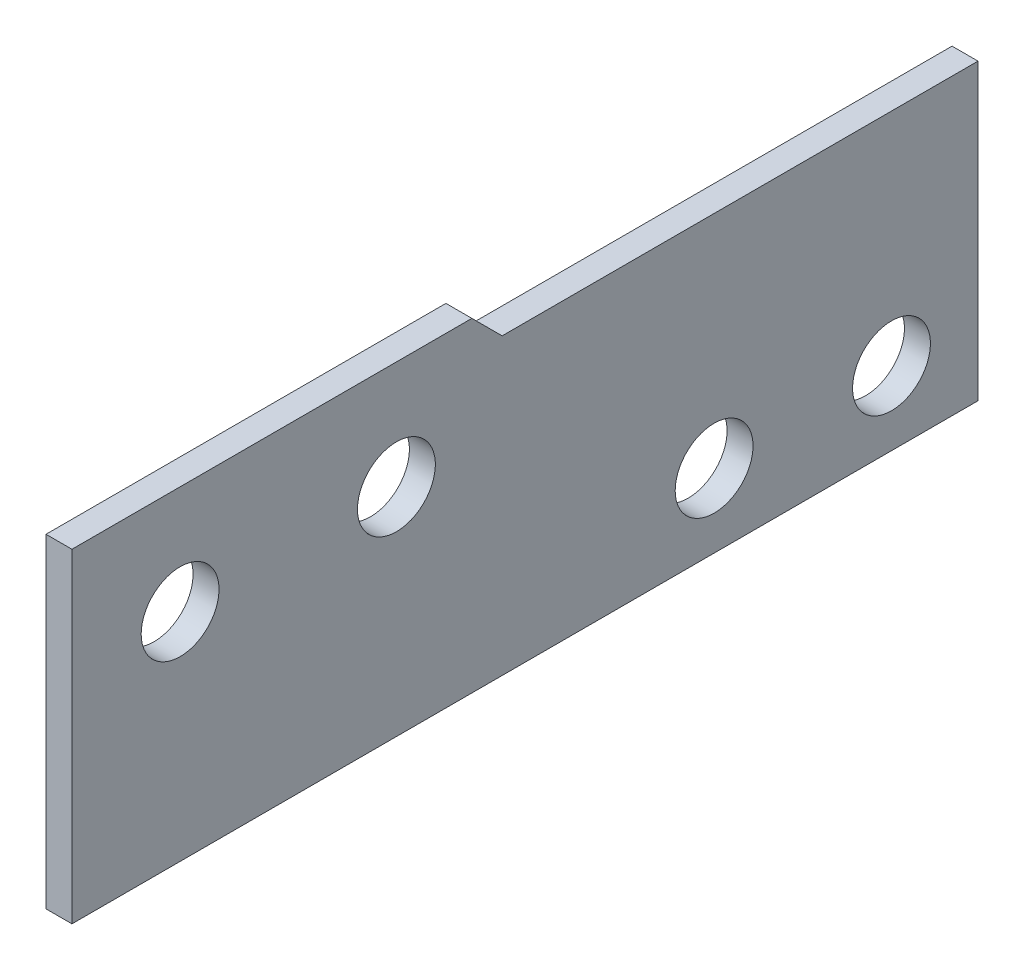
ISO-10303-21;
HEADER;
FILE_DESCRIPTION(('STEP AP214'),'2;1');
FILE_NAME('part.step','',(''),(''),'','','');
FILE_SCHEMA(('AUTOMOTIVE_DESIGN { 1 0 10303 214 1 1 1 1 }'));
ENDSEC;
DATA;
#1=APPLICATION_CONTEXT('core data for automotive mechanical design processes');
#2=APPLICATION_PROTOCOL_DEFINITION('international standard','automotive_design',2000,#1);
#3=PRODUCT_CONTEXT('',#1,'mechanical');
#4=PRODUCT('Part','Part','',(#3));
#5=PRODUCT_RELATED_PRODUCT_CATEGORY('part','',(#4));
#6=PRODUCT_DEFINITION_FORMATION('','',#4);
#7=PRODUCT_DEFINITION_CONTEXT('part definition',#1,'design');
#8=PRODUCT_DEFINITION('design','',#6,#7);
#9=PRODUCT_DEFINITION_SHAPE('','',#8);
#10=(LENGTH_UNIT() NAMED_UNIT(*) SI_UNIT(.MILLI.,.METRE.));
#11=(NAMED_UNIT(*) PLANE_ANGLE_UNIT() SI_UNIT($,.RADIAN.));
#12=(NAMED_UNIT(*) SI_UNIT($,.STERADIAN.) SOLID_ANGLE_UNIT());
#13=UNCERTAINTY_MEASURE_WITH_UNIT(LENGTH_MEASURE(1.E-05),#10,'distance_accuracy_value','');
#14=(GEOMETRIC_REPRESENTATION_CONTEXT(3) GLOBAL_UNCERTAINTY_ASSIGNED_CONTEXT((#13)) GLOBAL_UNIT_ASSIGNED_CONTEXT((#10,
#11,#12)) REPRESENTATION_CONTEXT('',''));
#15=CARTESIAN_POINT('',(0.,0.,0.));
#16=DIRECTION('',(0.,0.,1.));
#17=DIRECTION('',(1.,0.,0.));
#18=AXIS2_PLACEMENT_3D('',#15,#16,#17);
#19=CARTESIAN_POINT('',(0.,0.,20.94448637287));
#20=DIRECTION('',(-1.,0.,0.));
#21=DIRECTION('',(0.,0.,1.));
#22=AXIS2_PLACEMENT_3D('',#19,#20,#21);
#23=PLANE('',#22);
#24=CARTESIAN_POINT('',(0.,5.,18.44448637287));
#25=DIRECTION('',(-1.,0.,0.));
#26=DIRECTION('',(0.,0.,1.));
#27=AXIS2_PLACEMENT_3D('',#24,#25,#26);
#28=CIRCLE('',#27,0.9);
#29=CARTESIAN_POINT('',(0.,5.,19.34448637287));
#30=VERTEX_POINT('',#29);
#31=EDGE_CURVE('E104',#30,#30,#28,.F.);
#32=ORIENTED_EDGE('',*,*,#31,.T.);
#33=EDGE_LOOP('',(#32));
#34=FACE_BOUND('',#33,.T.);
#35=CARTESIAN_POINT('',(0.,5.,13.44448637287));
#36=DIRECTION('',(-1.,0.,0.));
#37=DIRECTION('',(0.,0.,1.));
#38=AXIS2_PLACEMENT_3D('',#35,#36,#37);
#39=CIRCLE('',#38,0.9);
#40=CARTESIAN_POINT('',(0.,5.,14.34448637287));
#41=VERTEX_POINT('',#40);
#42=EDGE_CURVE('E108',#41,#41,#39,.F.);
#43=ORIENTED_EDGE('',*,*,#42,.T.);
#44=EDGE_LOOP('',(#43));
#45=FACE_BOUND('',#44,.T.);
#46=CARTESIAN_POINT('',(0.,1.7,6.1));
#47=DIRECTION('',(-1.,0.,0.));
#48=DIRECTION('',(0.,0.,1.));
#49=AXIS2_PLACEMENT_3D('',#46,#47,#48);
#50=CIRCLE('',#49,0.9);
#51=CARTESIAN_POINT('',(0.,1.7,7.));
#52=VERTEX_POINT('',#51);
#53=EDGE_CURVE('E110',#52,#52,#50,.F.);
#54=ORIENTED_EDGE('',*,*,#53,.T.);
#55=EDGE_LOOP('',(#54));
#56=FACE_BOUND('',#55,.T.);
#57=CARTESIAN_POINT('',(0.,1.7,2.));
#58=DIRECTION('',(-1.,0.,0.));
#59=DIRECTION('',(0.,0.,1.));
#60=AXIS2_PLACEMENT_3D('',#57,#58,#59);
#61=CIRCLE('',#60,0.9);
#62=CARTESIAN_POINT('',(0.,1.7,2.9));
#63=VERTEX_POINT('',#62);
#64=EDGE_CURVE('E20',#63,#63,#61,.F.);
#65=ORIENTED_EDGE('',*,*,#64,.T.);
#66=EDGE_LOOP('',(#65));
#67=FACE_BOUND('',#66,.T.);
#68=DIRECTION('',(0.,0.,-1.));
#69=VECTOR('',#68,1.);
#70=CARTESIAN_POINT('',(0.,7.5,11.7));
#71=LINE('',#70,#69);
#72=CARTESIAN_POINT('',(0.,7.5,20.94448637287));
#73=VERTEX_POINT('',#72);
#74=CARTESIAN_POINT('',(0.,7.5,11.7));
#75=VERTEX_POINT('',#74);
#76=EDGE_CURVE('E67',#73,#75,#71,.T.);
#77=ORIENTED_EDGE('',*,*,#76,.T.);
#78=DIRECTION('',(0.,-0.707106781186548,-0.707106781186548));
#79=VECTOR('',#78,1.);
#80=CARTESIAN_POINT('',(0.,6.8,11.));
#81=LINE('',#80,#79);
#82=CARTESIAN_POINT('',(0.,6.8,11.));
#83=VERTEX_POINT('',#82);
#84=EDGE_CURVE('E69',#75,#83,#81,.T.);
#85=ORIENTED_EDGE('',*,*,#84,.T.);
#86=DIRECTION('',(0.,0.,-1.));
#87=VECTOR('',#86,1.);
#88=CARTESIAN_POINT('',(0.,6.8,0.));
#89=LINE('',#88,#87);
#90=CARTESIAN_POINT('',(0.,6.8,0.));
#91=VERTEX_POINT('',#90);
#92=EDGE_CURVE('E72',#83,#91,#89,.T.);
#93=ORIENTED_EDGE('',*,*,#92,.T.);
#94=DIRECTION('',(0.,1.,0.));
#95=VECTOR('',#94,1.);
#96=CARTESIAN_POINT('',(0.,0.,0.));
#97=LINE('',#96,#95);
#98=CARTESIAN_POINT('',(0.,0.,0.));
#99=VERTEX_POINT('',#98);
#100=EDGE_CURVE('E115',#99,#91,#97,.T.);
#101=ORIENTED_EDGE('',*,*,#100,.F.);
#102=DIRECTION('',(0.,0.,-1.));
#103=VECTOR('',#102,1.);
#104=CARTESIAN_POINT('',(0.,0.,0.));
#105=LINE('',#104,#103);
#106=CARTESIAN_POINT('',(0.,0.,20.94448637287));
#107=VERTEX_POINT('',#106);
#108=EDGE_CURVE('E125',#107,#99,#105,.T.);
#109=ORIENTED_EDGE('',*,*,#108,.F.);
#110=DIRECTION('',(0.,1.,0.));
#111=VECTOR('',#110,1.);
#112=CARTESIAN_POINT('',(0.,0.,20.94448637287));
#113=LINE('',#112,#111);
#114=EDGE_CURVE('E130',#73,#107,#113,.F.);
#115=ORIENTED_EDGE('',*,*,#114,.F.);
#116=EDGE_LOOP('',(#77,#85,#93,#101,#109,#115));
#117=FACE_BOUND('',#116,.T.);
#118=ADVANCED_FACE('F17',(#34,#45,#56,#67,#117),#23,.T.);
#119=CARTESIAN_POINT('',(0.,6.8,0.));
#120=DIRECTION('',(0.,-1.,0.));
#121=DIRECTION('',(0.,0.,-1.));
#122=AXIS2_PLACEMENT_3D('',#119,#120,#121);
#123=PLANE('',#122);
#124=DIRECTION('',(-1.,0.,0.));
#125=VECTOR('',#124,1.);
#126=CARTESIAN_POINT('',(0.,6.8,0.));
#127=LINE('',#126,#125);
#128=CARTESIAN_POINT('',(0.6,6.8,0.));
#129=VERTEX_POINT('',#128);
#130=EDGE_CURVE('E83',#91,#129,#127,.F.);
#131=ORIENTED_EDGE('',*,*,#130,.F.);
#132=ORIENTED_EDGE('',*,*,#92,.F.);
#133=DIRECTION('',(1.,0.,0.));
#134=VECTOR('',#133,1.);
#135=CARTESIAN_POINT('',(0.,6.8,11.));
#136=LINE('',#135,#134);
#137=CARTESIAN_POINT('',(0.6,6.8,11.));
#138=VERTEX_POINT('',#137);
#139=EDGE_CURVE('E77',#83,#138,#136,.T.);
#140=ORIENTED_EDGE('',*,*,#139,.T.);
#141=DIRECTION('',(0.,0.,-1.));
#142=VECTOR('',#141,1.);
#143=CARTESIAN_POINT('',(0.6,6.8,10.94448637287));
#144=LINE('',#143,#142);
#145=EDGE_CURVE('E107',#129,#138,#144,.F.);
#146=ORIENTED_EDGE('',*,*,#145,.F.);
#147=EDGE_LOOP('',(#131,#132,#140,#146));
#148=FACE_BOUND('',#147,.T.);
#149=ADVANCED_FACE('F80',(#148),#123,.F.);
#150=CARTESIAN_POINT('',(0.,6.8,11.));
#151=DIRECTION('',(0.,-0.707106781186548,0.707106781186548));
#152=DIRECTION('',(0.,-0.707106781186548,-0.707106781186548));
#153=AXIS2_PLACEMENT_3D('',#150,#151,#152);
#154=PLANE('',#153);
#155=ORIENTED_EDGE('',*,*,#139,.F.);
#156=ORIENTED_EDGE('',*,*,#84,.F.);
#157=DIRECTION('',(1.,0.,0.));
#158=VECTOR('',#157,1.);
#159=CARTESIAN_POINT('',(0.,7.5,11.7));
#160=LINE('',#159,#158);
#161=CARTESIAN_POINT('',(0.6,7.5,11.7));
#162=VERTEX_POINT('',#161);
#163=EDGE_CURVE('E91',#75,#162,#160,.T.);
#164=ORIENTED_EDGE('',*,*,#163,.T.);
#165=DIRECTION('',(0.,0.707106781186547,0.707106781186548));
#166=VECTOR('',#165,1.);
#167=CARTESIAN_POINT('',(0.6,6.8,11.));
#168=LINE('',#167,#166);
#169=EDGE_CURVE('E88',#138,#162,#168,.T.);
#170=ORIENTED_EDGE('',*,*,#169,.F.);
#171=EDGE_LOOP('',(#155,#156,#164,#170));
#172=FACE_BOUND('',#171,.T.);
#173=ADVANCED_FACE('F86',(#172),#154,.F.);
#174=CARTESIAN_POINT('',(0.,7.5,11.7));
#175=DIRECTION('',(0.,-1.,0.));
#176=DIRECTION('',(0.,0.,-1.));
#177=AXIS2_PLACEMENT_3D('',#174,#175,#176);
#178=PLANE('',#177);
#179=ORIENTED_EDGE('',*,*,#163,.F.);
#180=ORIENTED_EDGE('',*,*,#76,.F.);
#181=DIRECTION('',(1.,0.,0.));
#182=VECTOR('',#181,1.);
#183=CARTESIAN_POINT('',(0.6,7.5,20.94448637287));
#184=LINE('',#183,#182);
#185=CARTESIAN_POINT('',(0.6,7.5,20.94448637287));
#186=VERTEX_POINT('',#185);
#187=EDGE_CURVE('E132',#186,#73,#184,.F.);
#188=ORIENTED_EDGE('',*,*,#187,.F.);
#189=DIRECTION('',(0.,0.,-1.));
#190=VECTOR('',#189,1.);
#191=CARTESIAN_POINT('',(0.6,7.5,10.94448637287));
#192=LINE('',#191,#190);
#193=EDGE_CURVE('E137',#162,#186,#192,.F.);
#194=ORIENTED_EDGE('',*,*,#193,.F.);
#195=EDGE_LOOP('',(#179,#180,#188,#194));
#196=FACE_BOUND('',#195,.T.);
#197=ADVANCED_FACE('F138',(#196),#178,.F.);
#198=CARTESIAN_POINT('',(0.6,0.,20.94448637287));
#199=DIRECTION('',(0.,0.,1.));
#200=DIRECTION('',(1.,0.,0.));
#201=AXIS2_PLACEMENT_3D('',#198,#199,#200);
#202=PLANE('',#201);
#203=DIRECTION('',(1.,0.,0.));
#204=VECTOR('',#203,1.);
#205=CARTESIAN_POINT('',(0.,0.,20.94448637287));
#206=LINE('',#205,#204);
#207=CARTESIAN_POINT('',(0.6,0.,20.94448637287));
#208=VERTEX_POINT('',#207);
#209=EDGE_CURVE('E127',#208,#107,#206,.F.);
#210=ORIENTED_EDGE('',*,*,#209,.F.);
#211=DIRECTION('',(0.,1.,0.));
#212=VECTOR('',#211,1.);
#213=CARTESIAN_POINT('',(0.6,0.,20.94448637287));
#214=LINE('',#213,#212);
#215=EDGE_CURVE('E142',#186,#208,#214,.F.);
#216=ORIENTED_EDGE('',*,*,#215,.F.);
#217=ORIENTED_EDGE('',*,*,#187,.T.);
#218=ORIENTED_EDGE('',*,*,#114,.T.);
#219=EDGE_LOOP('',(#210,#216,#217,#218));
#220=FACE_BOUND('',#219,.T.);
#221=ADVANCED_FACE('F164',(#220),#202,.T.);
#222=CARTESIAN_POINT('',(0.,0.,0.));
#223=DIRECTION('',(0.,-1.,0.));
#224=DIRECTION('',(0.,0.,-1.));
#225=AXIS2_PLACEMENT_3D('',#222,#223,#224);
#226=PLANE('',#225);
#227=ORIENTED_EDGE('',*,*,#108,.T.);
#228=DIRECTION('',(-1.,0.,0.));
#229=VECTOR('',#228,1.);
#230=CARTESIAN_POINT('',(0.,0.,0.));
#231=LINE('',#230,#229);
#232=CARTESIAN_POINT('',(0.6,0.,0.));
#233=VERTEX_POINT('',#232);
#234=EDGE_CURVE('E35',#233,#99,#231,.T.);
#235=ORIENTED_EDGE('',*,*,#234,.F.);
#236=DIRECTION('',(0.,0.,-1.));
#237=VECTOR('',#236,1.);
#238=CARTESIAN_POINT('',(0.6,0.,10.94448637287));
#239=LINE('',#238,#237);
#240=EDGE_CURVE('E149',#208,#233,#239,.T.);
#241=ORIENTED_EDGE('',*,*,#240,.F.);
#242=ORIENTED_EDGE('',*,*,#209,.T.);
#243=EDGE_LOOP('',(#227,#235,#241,#242));
#244=FACE_BOUND('',#243,.T.);
#245=ADVANCED_FACE('F154',(#244),#226,.T.);
#246=CARTESIAN_POINT('',(0.,0.,0.));
#247=DIRECTION('',(0.,0.,-1.));
#248=DIRECTION('',(-1.,0.,0.));
#249=AXIS2_PLACEMENT_3D('',#246,#247,#248);
#250=PLANE('',#249);
#251=ORIENTED_EDGE('',*,*,#234,.T.);
#252=ORIENTED_EDGE('',*,*,#100,.T.);
#253=ORIENTED_EDGE('',*,*,#130,.T.);
#254=DIRECTION('',(0.,1.,0.));
#255=VECTOR('',#254,1.);
#256=CARTESIAN_POINT('',(0.6,0.,0.));
#257=LINE('',#256,#255);
#258=EDGE_CURVE('E103',#233,#129,#257,.T.);
#259=ORIENTED_EDGE('',*,*,#258,.F.);
#260=EDGE_LOOP('',(#251,#252,#253,#259));
#261=FACE_BOUND('',#260,.T.);
#262=ADVANCED_FACE('F151',(#261),#250,.T.);
#263=CARTESIAN_POINT('',(0.,1.7,2.));
#264=DIRECTION('',(-1.,0.,0.));
#265=DIRECTION('',(0.,0.,1.));
#266=AXIS2_PLACEMENT_3D('',#263,#264,#265);
#267=CYLINDRICAL_SURFACE('',#266,0.9);
#268=CARTESIAN_POINT('',(0.6,1.7,2.));
#269=DIRECTION('',(-1.,0.,0.));
#270=DIRECTION('',(0.,0.,1.));
#271=AXIS2_PLACEMENT_3D('',#268,#269,#270);
#272=CIRCLE('',#271,0.9);
#273=CARTESIAN_POINT('',(0.6,1.7,2.9));
#274=VERTEX_POINT('',#273);
#275=EDGE_CURVE('E100',#274,#274,#272,.T.);
#276=ORIENTED_EDGE('',*,*,#275,.F.);
#277=EDGE_LOOP('',(#276));
#278=FACE_BOUND('',#277,.T.);
#279=ORIENTED_EDGE('',*,*,#64,.F.);
#280=EDGE_LOOP('',(#279));
#281=FACE_BOUND('',#280,.T.);
#282=ADVANCED_FACE('F153',(#278,#281),#267,.F.);
#283=CARTESIAN_POINT('',(0.,1.7,6.1));
#284=DIRECTION('',(-1.,0.,0.));
#285=DIRECTION('',(0.,0.,1.));
#286=AXIS2_PLACEMENT_3D('',#283,#284,#285);
#287=CYLINDRICAL_SURFACE('',#286,0.9);
#288=CARTESIAN_POINT('',(0.6,1.7,6.1));
#289=DIRECTION('',(-1.,0.,0.));
#290=DIRECTION('',(0.,0.,1.));
#291=AXIS2_PLACEMENT_3D('',#288,#289,#290);
#292=CIRCLE('',#291,0.9);
#293=CARTESIAN_POINT('',(0.6,1.7,7.));
#294=VERTEX_POINT('',#293);
#295=EDGE_CURVE('E97',#294,#294,#292,.T.);
#296=ORIENTED_EDGE('',*,*,#295,.F.);
#297=EDGE_LOOP('',(#296));
#298=FACE_BOUND('',#297,.T.);
#299=ORIENTED_EDGE('',*,*,#53,.F.);
#300=EDGE_LOOP('',(#299));
#301=FACE_BOUND('',#300,.T.);
#302=ADVANCED_FACE('F161',(#298,#301),#287,.F.);
#303=CARTESIAN_POINT('',(2.5,5.,13.44448637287));
#304=DIRECTION('',(-1.,0.,0.));
#305=DIRECTION('',(0.,0.,1.));
#306=AXIS2_PLACEMENT_3D('',#303,#304,#305);
#307=CYLINDRICAL_SURFACE('',#306,0.9);
#308=ORIENTED_EDGE('',*,*,#42,.F.);
#309=EDGE_LOOP('',(#308));
#310=FACE_BOUND('',#309,.T.);
#311=CARTESIAN_POINT('',(0.6,5.,13.44448637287));
#312=DIRECTION('',(-1.,0.,0.));
#313=DIRECTION('',(0.,0.,1.));
#314=AXIS2_PLACEMENT_3D('',#311,#312,#313);
#315=CIRCLE('',#314,0.9);
#316=CARTESIAN_POINT('',(0.6,5.,14.34448637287));
#317=VERTEX_POINT('',#316);
#318=EDGE_CURVE('E26',#317,#317,#315,.T.);
#319=ORIENTED_EDGE('',*,*,#318,.F.);
#320=EDGE_LOOP('',(#319));
#321=FACE_BOUND('',#320,.T.);
#322=ADVANCED_FACE('F173',(#310,#321),#307,.F.);
#323=CARTESIAN_POINT('',(2.5,5.,18.44448637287));
#324=DIRECTION('',(-1.,0.,0.));
#325=DIRECTION('',(0.,0.,1.));
#326=AXIS2_PLACEMENT_3D('',#323,#324,#325);
#327=CYLINDRICAL_SURFACE('',#326,0.9);
#328=ORIENTED_EDGE('',*,*,#31,.F.);
#329=EDGE_LOOP('',(#328));
#330=FACE_BOUND('',#329,.T.);
#331=CARTESIAN_POINT('',(0.6,5.,18.44448637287));
#332=DIRECTION('',(-1.,0.,0.));
#333=DIRECTION('',(0.,0.,1.));
#334=AXIS2_PLACEMENT_3D('',#331,#332,#333);
#335=CIRCLE('',#334,0.9);
#336=CARTESIAN_POINT('',(0.6,5.,19.34448637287));
#337=VERTEX_POINT('',#336);
#338=EDGE_CURVE('E11',#337,#337,#335,.T.);
#339=ORIENTED_EDGE('',*,*,#338,.F.);
#340=EDGE_LOOP('',(#339));
#341=FACE_BOUND('',#340,.T.);
#342=ADVANCED_FACE('F167',(#330,#341),#327,.F.);
#343=CARTESIAN_POINT('',(0.6,0.,10.94448637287));
#344=DIRECTION('',(1.,0.,0.));
#345=DIRECTION('',(0.,0.,-1.));
#346=AXIS2_PLACEMENT_3D('',#343,#344,#345);
#347=PLANE('',#346);
#348=ORIENTED_EDGE('',*,*,#338,.T.);
#349=EDGE_LOOP('',(#348));
#350=FACE_BOUND('',#349,.T.);
#351=ORIENTED_EDGE('',*,*,#318,.T.);
#352=EDGE_LOOP('',(#351));
#353=FACE_BOUND('',#352,.T.);
#354=ORIENTED_EDGE('',*,*,#295,.T.);
#355=EDGE_LOOP('',(#354));
#356=FACE_BOUND('',#355,.T.);
#357=ORIENTED_EDGE('',*,*,#275,.T.);
#358=EDGE_LOOP('',(#357));
#359=FACE_BOUND('',#358,.T.);
#360=ORIENTED_EDGE('',*,*,#240,.T.);
#361=ORIENTED_EDGE('',*,*,#258,.T.);
#362=ORIENTED_EDGE('',*,*,#145,.T.);
#363=ORIENTED_EDGE('',*,*,#169,.T.);
#364=ORIENTED_EDGE('',*,*,#193,.T.);
#365=ORIENTED_EDGE('',*,*,#215,.T.);
#366=EDGE_LOOP('',(#360,#361,#362,#363,#364,#365));
#367=FACE_BOUND('',#366,.T.);
#368=ADVANCED_FACE('F145',(#350,#353,#356,#359,#367),#347,.T.);
#369=CLOSED_SHELL('',(#118,#149,#173,#197,#221,#245,#262,#282,#302,#322,#342,#368));
#370=MANIFOLD_SOLID_BREP('B1',#369);
#371=ADVANCED_BREP_SHAPE_REPRESENTATION('',(#18,#370),#14);
#372=SHAPE_DEFINITION_REPRESENTATION(#9,#371);
ENDSEC;
END-ISO-10303-21;
